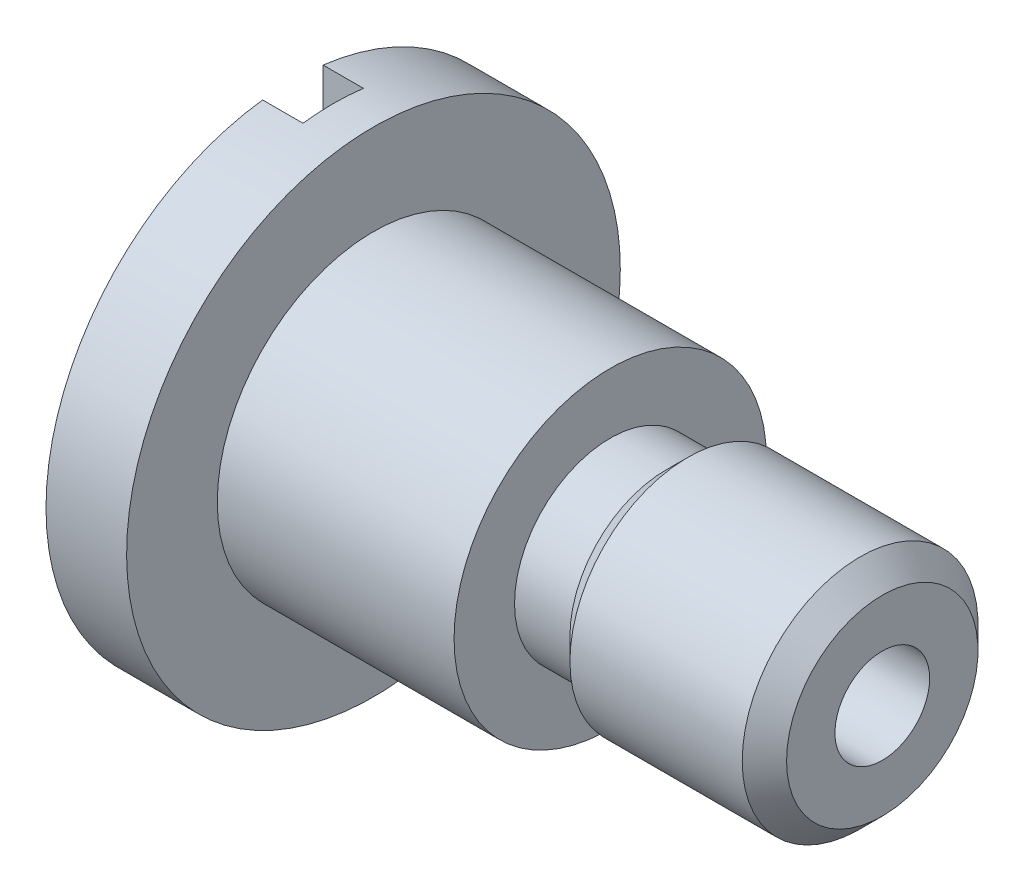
ISO-10303-21;
HEADER;
FILE_DESCRIPTION(('STEP AP214'),'2;1');
FILE_NAME('part.step','',(''),(''),'','','');
FILE_SCHEMA(('AUTOMOTIVE_DESIGN { 1 0 10303 214 1 1 1 1 }'));
ENDSEC;
DATA;
#1=APPLICATION_CONTEXT('core data for automotive mechanical design processes');
#2=APPLICATION_PROTOCOL_DEFINITION('international standard','automotive_design',2000,#1);
#3=PRODUCT_CONTEXT('',#1,'mechanical');
#4=PRODUCT('Part','Part','',(#3));
#5=PRODUCT_RELATED_PRODUCT_CATEGORY('part','',(#4));
#6=PRODUCT_DEFINITION_FORMATION('','',#4);
#7=PRODUCT_DEFINITION_CONTEXT('part definition',#1,'design');
#8=PRODUCT_DEFINITION('design','',#6,#7);
#9=PRODUCT_DEFINITION_SHAPE('','',#8);
#10=(LENGTH_UNIT() NAMED_UNIT(*) SI_UNIT(.MILLI.,.METRE.));
#11=(NAMED_UNIT(*) PLANE_ANGLE_UNIT() SI_UNIT($,.RADIAN.));
#12=(NAMED_UNIT(*) SI_UNIT($,.STERADIAN.) SOLID_ANGLE_UNIT());
#13=UNCERTAINTY_MEASURE_WITH_UNIT(LENGTH_MEASURE(1.E-05),#10,'distance_accuracy_value','');
#14=(GEOMETRIC_REPRESENTATION_CONTEXT(3) GLOBAL_UNCERTAINTY_ASSIGNED_CONTEXT((#13)) GLOBAL_UNIT_ASSIGNED_CONTEXT((#10,
#11,#12)) REPRESENTATION_CONTEXT('',''));
#15=CARTESIAN_POINT('',(0.,0.,0.));
#16=DIRECTION('',(0.,0.,1.));
#17=DIRECTION('',(1.,0.,0.));
#18=AXIS2_PLACEMENT_3D('',#15,#16,#17);
#19=CARTESIAN_POINT('',(1.016,0.,0.));
#20=DIRECTION('',(1.,0.,0.));
#21=DIRECTION('',(0.,0.,-1.));
#22=AXIS2_PLACEMENT_3D('',#19,#20,#21);
#23=PLANE('',#22);
#24=DIRECTION('',(0.,-1.,0.));
#25=VECTOR('',#24,1.);
#26=CARTESIAN_POINT('',(1.016,-6.223,-0.762));
#27=LINE('',#26,#25);
#28=CARTESIAN_POINT('',(1.016,6.17617073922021,-0.762));
#29=VERTEX_POINT('',#28);
#30=CARTESIAN_POINT('',(1.016,0.918974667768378,-0.762));
#31=VERTEX_POINT('',#30);
#32=EDGE_CURVE('E117',#29,#31,#27,.T.);
#33=ORIENTED_EDGE('',*,*,#32,.T.);
#34=CARTESIAN_POINT('',(1.016,0.,0.));
#35=DIRECTION('',(1.,0.,0.));
#36=DIRECTION('',(0.,0.,-1.));
#37=AXIS2_PLACEMENT_3D('',#34,#35,#36);
#38=CIRCLE('',#37,1.1938);
#39=CARTESIAN_POINT('',(1.016,0.918974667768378,0.762));
#40=VERTEX_POINT('',#39);
#41=EDGE_CURVE('E103',#31,#40,#38,.T.);
#42=ORIENTED_EDGE('',*,*,#41,.T.);
#43=DIRECTION('',(0.,1.,0.));
#44=VECTOR('',#43,1.);
#45=CARTESIAN_POINT('',(1.016,-6.223,0.762));
#46=LINE('',#45,#44);
#47=CARTESIAN_POINT('',(1.016,6.17617073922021,0.762));
#48=VERTEX_POINT('',#47);
#49=EDGE_CURVE('E273',#40,#48,#46,.T.);
#50=ORIENTED_EDGE('',*,*,#49,.T.);
#51=CARTESIAN_POINT('',(1.016,0.,0.));
#52=DIRECTION('',(1.,0.,0.));
#53=DIRECTION('',(0.,0.,-1.));
#54=AXIS2_PLACEMENT_3D('',#51,#52,#53);
#55=CIRCLE('',#54,6.223);
#56=EDGE_CURVE('E10',#29,#48,#55,.T.);
#57=ORIENTED_EDGE('',*,*,#56,.F.);
#58=EDGE_LOOP('',(#33,#42,#50,#57));
#59=FACE_BOUND('',#58,.T.);
#60=ADVANCED_FACE('F16',(#59),#23,.F.);
#61=CARTESIAN_POINT('',(1.016,-6.223,0.762));
#62=DIRECTION('',(0.,0.,1.));
#63=DIRECTION('',(1.,0.,0.));
#64=AXIS2_PLACEMENT_3D('',#61,#62,#63);
#65=PLANE('',#64);
#66=DIRECTION('',(0.,-1.,0.));
#67=VECTOR('',#66,1.);
#68=CARTESIAN_POINT('',(0.,0.,0.762));
#69=LINE('',#68,#67);
#70=CARTESIAN_POINT('',(0.,-0.918974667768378,0.762));
#71=VERTEX_POINT('',#70);
#72=CARTESIAN_POINT('',(0.,-6.17617073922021,0.762));
#73=VERTEX_POINT('',#72);
#74=EDGE_CURVE('E189',#71,#73,#69,.T.);
#75=ORIENTED_EDGE('',*,*,#74,.F.);
#76=DIRECTION('',(1.,0.,0.));
#77=VECTOR('',#76,1.);
#78=CARTESIAN_POINT('',(0.,-0.918974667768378,0.762));
#79=LINE('',#78,#77);
#80=CARTESIAN_POINT('',(1.016,-0.918974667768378,0.762));
#81=VERTEX_POINT('',#80);
#82=EDGE_CURVE('E235',#71,#81,#79,.T.);
#83=ORIENTED_EDGE('',*,*,#82,.T.);
#84=CARTESIAN_POINT('',(1.016,-6.17617073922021,0.762));
#85=VERTEX_POINT('',#84);
#86=EDGE_CURVE('E135',#85,#81,#46,.T.);
#87=ORIENTED_EDGE('',*,*,#86,.F.);
#88=DIRECTION('',(-1.,0.,0.));
#89=VECTOR('',#88,1.);
#90=CARTESIAN_POINT('',(0.,-6.17617073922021,0.762));
#91=LINE('',#90,#89);
#92=EDGE_CURVE('E142',#73,#85,#91,.F.);
#93=ORIENTED_EDGE('',*,*,#92,.F.);
#94=EDGE_LOOP('',(#75,#83,#87,#93));
#95=FACE_BOUND('',#94,.T.);
#96=ADVANCED_FACE('F213',(#95),#65,.F.);
#97=CARTESIAN_POINT('',(1.016,-6.223,-0.762));
#98=DIRECTION('',(0.,0.,-1.));
#99=DIRECTION('',(-1.,0.,0.));
#100=AXIS2_PLACEMENT_3D('',#97,#98,#99);
#101=PLANE('',#100);
#102=DIRECTION('',(0.,1.,0.));
#103=VECTOR('',#102,1.);
#104=CARTESIAN_POINT('',(0.,0.,-0.762));
#105=LINE('',#104,#103);
#106=CARTESIAN_POINT('',(0.,0.918974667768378,-0.762));
#107=VERTEX_POINT('',#106);
#108=CARTESIAN_POINT('',(0.,6.17617073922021,-0.762));
#109=VERTEX_POINT('',#108);
#110=EDGE_CURVE('E47',#107,#109,#105,.T.);
#111=ORIENTED_EDGE('',*,*,#110,.F.);
#112=DIRECTION('',(1.,0.,0.));
#113=VECTOR('',#112,1.);
#114=CARTESIAN_POINT('',(0.,0.918974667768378,-0.762));
#115=LINE('',#114,#113);
#116=EDGE_CURVE('E36',#107,#31,#115,.T.);
#117=ORIENTED_EDGE('',*,*,#116,.T.);
#118=ORIENTED_EDGE('',*,*,#32,.F.);
#119=DIRECTION('',(-1.,0.,0.));
#120=VECTOR('',#119,1.);
#121=CARTESIAN_POINT('',(0.,6.17617073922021,-0.762));
#122=LINE('',#121,#120);
#123=EDGE_CURVE('E123',#109,#29,#122,.F.);
#124=ORIENTED_EDGE('',*,*,#123,.F.);
#125=EDGE_LOOP('',(#111,#117,#118,#124));
#126=FACE_BOUND('',#125,.T.);
#127=ADVANCED_FACE('F116',(#126),#101,.F.);
#128=ORIENTED_EDGE('',*,*,#86,.T.);
#129=CARTESIAN_POINT('',(1.016,-0.918974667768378,-0.762));
#130=VERTEX_POINT('',#129);
#131=EDGE_CURVE('E113',#81,#130,#38,.T.);
#132=ORIENTED_EDGE('',*,*,#131,.T.);
#133=CARTESIAN_POINT('',(1.016,-6.17617073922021,-0.762));
#134=VERTEX_POINT('',#133);
#135=EDGE_CURVE('E124',#130,#134,#27,.T.);
#136=ORIENTED_EDGE('',*,*,#135,.T.);
#137=EDGE_CURVE('E20',#85,#134,#55,.T.);
#138=ORIENTED_EDGE('',*,*,#137,.F.);
#139=EDGE_LOOP('',(#128,#132,#136,#138));
#140=FACE_BOUND('',#139,.T.);
#141=ADVANCED_FACE('F452',(#140),#23,.F.);
#142=ORIENTED_EDGE('',*,*,#49,.F.);
#143=DIRECTION('',(1.,0.,0.));
#144=VECTOR('',#143,1.);
#145=CARTESIAN_POINT('',(0.,0.918974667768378,0.762));
#146=LINE('',#145,#144);
#147=CARTESIAN_POINT('',(0.,0.918974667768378,0.762));
#148=VERTEX_POINT('',#147);
#149=EDGE_CURVE('E106',#40,#148,#146,.F.);
#150=ORIENTED_EDGE('',*,*,#149,.T.);
#151=CARTESIAN_POINT('',(0.,6.17617073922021,0.762));
#152=VERTEX_POINT('',#151);
#153=EDGE_CURVE('E190',#152,#148,#69,.T.);
#154=ORIENTED_EDGE('',*,*,#153,.F.);
#155=DIRECTION('',(-1.,0.,0.));
#156=VECTOR('',#155,1.);
#157=CARTESIAN_POINT('',(0.,6.17617073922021,0.762));
#158=LINE('',#157,#156);
#159=EDGE_CURVE('E146',#48,#152,#158,.T.);
#160=ORIENTED_EDGE('',*,*,#159,.F.);
#161=EDGE_LOOP('',(#142,#150,#154,#160));
#162=FACE_BOUND('',#161,.T.);
#163=ADVANCED_FACE('F363',(#162),#65,.F.);
#164=ORIENTED_EDGE('',*,*,#135,.F.);
#165=DIRECTION('',(1.,0.,0.));
#166=VECTOR('',#165,1.);
#167=CARTESIAN_POINT('',(0.,-0.918974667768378,-0.762));
#168=LINE('',#167,#166);
#169=CARTESIAN_POINT('',(0.,-0.918974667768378,-0.762));
#170=VERTEX_POINT('',#169);
#171=EDGE_CURVE('E375',#130,#170,#168,.F.);
#172=ORIENTED_EDGE('',*,*,#171,.T.);
#173=CARTESIAN_POINT('',(0.,-6.17617073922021,-0.762));
#174=VERTEX_POINT('',#173);
#175=EDGE_CURVE('E186',#174,#170,#105,.T.);
#176=ORIENTED_EDGE('',*,*,#175,.F.);
#177=DIRECTION('',(-1.,0.,0.));
#178=VECTOR('',#177,1.);
#179=CARTESIAN_POINT('',(0.,-6.17617073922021,-0.762));
#180=LINE('',#179,#178);
#181=EDGE_CURVE('E132',#134,#174,#180,.T.);
#182=ORIENTED_EDGE('',*,*,#181,.F.);
#183=EDGE_LOOP('',(#164,#172,#176,#182));
#184=FACE_BOUND('',#183,.T.);
#185=ADVANCED_FACE('F342',(#184),#101,.F.);
#186=CARTESIAN_POINT('',(0.,0.,0.));
#187=DIRECTION('',(1.,0.,0.));
#188=DIRECTION('',(0.,0.,-1.));
#189=AXIS2_PLACEMENT_3D('',#186,#187,#188);
#190=PLANE('',#189);
#191=ORIENTED_EDGE('',*,*,#153,.T.);
#192=CARTESIAN_POINT('',(0.,0.,0.));
#193=DIRECTION('',(1.,0.,0.));
#194=DIRECTION('',(0.,0.,-1.));
#195=AXIS2_PLACEMENT_3D('',#192,#193,#194);
#196=CIRCLE('',#195,1.1938);
#197=EDGE_CURVE('E209',#148,#71,#196,.T.);
#198=ORIENTED_EDGE('',*,*,#197,.T.);
#199=ORIENTED_EDGE('',*,*,#74,.T.);
#200=CARTESIAN_POINT('',(0.,0.,0.));
#201=DIRECTION('',(1.,0.,0.));
#202=DIRECTION('',(0.,0.,-1.));
#203=AXIS2_PLACEMENT_3D('',#200,#201,#202);
#204=CIRCLE('',#203,6.223);
#205=EDGE_CURVE('E161',#73,#152,#204,.F.);
#206=ORIENTED_EDGE('',*,*,#205,.T.);
#207=EDGE_LOOP('',(#191,#198,#199,#206));
#208=FACE_BOUND('',#207,.T.);
#209=ADVANCED_FACE('F207',(#208),#190,.F.);
#210=CARTESIAN_POINT('',(2.032,5.842,0.));
#211=DIRECTION('',(-1.,0.,0.));
#212=DIRECTION('',(0.,0.,1.));
#213=AXIS2_PLACEMENT_3D('',#210,#211,#212);
#214=PLANE('',#213);
#215=CARTESIAN_POINT('',(2.032,0.,0.));
#216=DIRECTION('',(-1.,0.,0.));
#217=DIRECTION('',(0.,0.,1.));
#218=AXIS2_PLACEMENT_3D('',#215,#216,#217);
#219=CIRCLE('',#218,3.937);
#220=CARTESIAN_POINT('',(2.032,0.,3.937));
#221=VERTEX_POINT('',#220);
#222=EDGE_CURVE('E182',#221,#221,#219,.T.);
#223=ORIENTED_EDGE('',*,*,#222,.T.);
#224=EDGE_LOOP('',(#223));
#225=FACE_BOUND('',#224,.T.);
#226=CARTESIAN_POINT('',(2.032,0.,0.));
#227=DIRECTION('',(1.,0.,0.));
#228=DIRECTION('',(0.,0.,-1.));
#229=AXIS2_PLACEMENT_3D('',#226,#227,#228);
#230=CIRCLE('',#229,6.223);
#231=CARTESIAN_POINT('',(2.032,0.,-6.223));
#232=VERTEX_POINT('',#231);
#233=EDGE_CURVE('E154',#232,#232,#230,.T.);
#234=ORIENTED_EDGE('',*,*,#233,.T.);
#235=EDGE_LOOP('',(#234));
#236=FACE_BOUND('',#235,.T.);
#237=ADVANCED_FACE('F229',(#225,#236),#214,.F.);
#238=CARTESIAN_POINT('',(0.,0.,0.));
#239=DIRECTION('',(-1.,0.,0.));
#240=DIRECTION('',(0.,0.,1.));
#241=AXIS2_PLACEMENT_3D('',#238,#239,#240);
#242=CYLINDRICAL_SURFACE('',#241,3.937);
#243=ORIENTED_EDGE('',*,*,#222,.F.);
#244=EDGE_LOOP('',(#243));
#245=FACE_BOUND('',#244,.T.);
#246=CARTESIAN_POINT('',(8.001,0.,0.));
#247=DIRECTION('',(1.,0.,0.));
#248=DIRECTION('',(0.,0.,-1.));
#249=AXIS2_PLACEMENT_3D('',#246,#247,#248);
#250=CIRCLE('',#249,3.937);
#251=CARTESIAN_POINT('',(8.001,0.,-3.937));
#252=VERTEX_POINT('',#251);
#253=EDGE_CURVE('E150',#252,#252,#250,.T.);
#254=ORIENTED_EDGE('',*,*,#253,.F.);
#255=EDGE_LOOP('',(#254));
#256=FACE_BOUND('',#255,.T.);
#257=ADVANCED_FACE('F258',(#245,#256),#242,.T.);
#258=CARTESIAN_POINT('',(0.,0.,0.));
#259=DIRECTION('',(-1.,0.,0.));
#260=DIRECTION('',(0.,0.,1.));
#261=AXIS2_PLACEMENT_3D('',#258,#259,#260);
#262=CYLINDRICAL_SURFACE('',#261,6.223);
#263=ORIENTED_EDGE('',*,*,#56,.T.);
#264=ORIENTED_EDGE('',*,*,#159,.T.);
#265=ORIENTED_EDGE('',*,*,#205,.F.);
#266=ORIENTED_EDGE('',*,*,#92,.T.);
#267=ORIENTED_EDGE('',*,*,#137,.T.);
#268=ORIENTED_EDGE('',*,*,#181,.T.);
#269=EDGE_CURVE('E158',#109,#174,#204,.F.);
#270=ORIENTED_EDGE('',*,*,#269,.F.);
#271=ORIENTED_EDGE('',*,*,#123,.T.);
#272=EDGE_LOOP('',(#263,#264,#265,#266,#267,#268,#270,#271));
#273=FACE_BOUND('',#272,.T.);
#274=ORIENTED_EDGE('',*,*,#233,.F.);
#275=EDGE_LOOP('',(#274));
#276=FACE_BOUND('',#275,.T.);
#277=ADVANCED_FACE('F216',(#273,#276),#262,.T.);
#278=ORIENTED_EDGE('',*,*,#175,.T.);
#279=EDGE_CURVE('E120',#170,#107,#196,.T.);
#280=ORIENTED_EDGE('',*,*,#279,.T.);
#281=ORIENTED_EDGE('',*,*,#110,.T.);
#282=ORIENTED_EDGE('',*,*,#269,.T.);
#283=EDGE_LOOP('',(#278,#280,#281,#282));
#284=FACE_BOUND('',#283,.T.);
#285=ADVANCED_FACE('F18',(#284),#190,.F.);
#286=CARTESIAN_POINT('',(9.9568,0.,0.));
#287=DIRECTION('',(1.,0.,0.));
#288=DIRECTION('',(0.,0.,-1.));
#289=AXIS2_PLACEMENT_3D('',#286,#287,#288);
#290=CONICAL_SURFACE('',#289,2.9718,0.785398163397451);
#291=CARTESIAN_POINT('',(9.398,0.,0.));
#292=DIRECTION('',(-1.,0.,0.));
#293=DIRECTION('',(0.,0.,1.));
#294=AXIS2_PLACEMENT_3D('',#291,#292,#293);
#295=CIRCLE('',#294,2.413);
#296=CARTESIAN_POINT('',(9.398,0.,2.413));
#297=VERTEX_POINT('',#296);
#298=EDGE_CURVE('E174',#297,#297,#295,.T.);
#299=ORIENTED_EDGE('',*,*,#298,.F.);
#300=EDGE_LOOP('',(#299));
#301=FACE_BOUND('',#300,.T.);
#302=CARTESIAN_POINT('',(9.9568,0.,0.));
#303=DIRECTION('',(-1.,0.,0.));
#304=DIRECTION('',(0.,0.,1.));
#305=AXIS2_PLACEMENT_3D('',#302,#303,#304);
#306=CIRCLE('',#305,2.9718);
#307=CARTESIAN_POINT('',(9.9568,0.,2.9718));
#308=VERTEX_POINT('',#307);
#309=EDGE_CURVE('E170',#308,#308,#306,.T.);
#310=ORIENTED_EDGE('',*,*,#309,.T.);
#311=EDGE_LOOP('',(#310));
#312=FACE_BOUND('',#311,.T.);
#313=ADVANCED_FACE('F407',(#301,#312),#290,.T.);
#314=CARTESIAN_POINT('',(0.,0.,0.));
#315=DIRECTION('',(-1.,0.,0.));
#316=DIRECTION('',(0.,0.,1.));
#317=AXIS2_PLACEMENT_3D('',#314,#315,#316);
#318=CYLINDRICAL_SURFACE('',#317,2.413);
#319=CARTESIAN_POINT('',(8.001,0.,0.));
#320=DIRECTION('',(-1.,0.,0.));
#321=DIRECTION('',(0.,0.,1.));
#322=AXIS2_PLACEMENT_3D('',#319,#320,#321);
#323=CIRCLE('',#322,2.413);
#324=CARTESIAN_POINT('',(8.001,0.,2.413));
#325=VERTEX_POINT('',#324);
#326=EDGE_CURVE('E178',#325,#325,#323,.T.);
#327=ORIENTED_EDGE('',*,*,#326,.F.);
#328=EDGE_LOOP('',(#327));
#329=FACE_BOUND('',#328,.T.);
#330=ORIENTED_EDGE('',*,*,#298,.T.);
#331=EDGE_LOOP('',(#330));
#332=FACE_BOUND('',#331,.T.);
#333=ADVANCED_FACE('F397',(#329,#332),#318,.T.);
#334=CARTESIAN_POINT('',(8.001,3.42899999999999,0.));
#335=DIRECTION('',(-1.,0.,0.));
#336=DIRECTION('',(0.,0.,1.));
#337=AXIS2_PLACEMENT_3D('',#334,#335,#336);
#338=PLANE('',#337);
#339=ORIENTED_EDGE('',*,*,#326,.T.);
#340=EDGE_LOOP('',(#339));
#341=FACE_BOUND('',#340,.T.);
#342=ORIENTED_EDGE('',*,*,#253,.T.);
#343=EDGE_LOOP('',(#342));
#344=FACE_BOUND('',#343,.T.);
#345=ADVANCED_FACE('F381',(#341,#344),#338,.F.);
#346=CARTESIAN_POINT('',(0.,0.,0.));
#347=DIRECTION('',(-1.,0.,0.));
#348=DIRECTION('',(0.,0.,1.));
#349=AXIS2_PLACEMENT_3D('',#346,#347,#348);
#350=CYLINDRICAL_SURFACE('',#349,2.9718);
#351=ORIENTED_EDGE('',*,*,#309,.F.);
#352=EDGE_LOOP('',(#351));
#353=FACE_BOUND('',#352,.T.);
#354=CARTESIAN_POINT('',(14.3002,0.,0.));
#355=DIRECTION('',(-1.,0.,0.));
#356=DIRECTION('',(0.,0.,1.));
#357=AXIS2_PLACEMENT_3D('',#354,#355,#356);
#358=CIRCLE('',#357,2.9718);
#359=CARTESIAN_POINT('',(14.3002,0.,2.9718));
#360=VERTEX_POINT('',#359);
#361=EDGE_CURVE('E166',#360,#360,#358,.T.);
#362=ORIENTED_EDGE('',*,*,#361,.T.);
#363=EDGE_LOOP('',(#362));
#364=FACE_BOUND('',#363,.T.);
#365=ADVANCED_FACE('F351',(#353,#364),#350,.T.);
#366=CARTESIAN_POINT('',(14.859,0.,0.));
#367=DIRECTION('',(-1.,0.,0.));
#368=DIRECTION('',(0.,0.,1.));
#369=AXIS2_PLACEMENT_3D('',#366,#367,#368);
#370=CONICAL_SURFACE('',#369,2.413,0.785398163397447);
#371=ORIENTED_EDGE('',*,*,#361,.F.);
#372=EDGE_LOOP('',(#371));
#373=FACE_BOUND('',#372,.T.);
#374=CARTESIAN_POINT('',(14.859,0.,0.));
#375=DIRECTION('',(-1.,0.,0.));
#376=DIRECTION('',(0.,0.,1.));
#377=AXIS2_PLACEMENT_3D('',#374,#375,#376);
#378=CIRCLE('',#377,2.413);
#379=CARTESIAN_POINT('',(14.859,0.,2.413));
#380=VERTEX_POINT('',#379);
#381=EDGE_CURVE('E162',#380,#380,#378,.T.);
#382=ORIENTED_EDGE('',*,*,#381,.T.);
#383=EDGE_LOOP('',(#382));
#384=FACE_BOUND('',#383,.T.);
#385=ADVANCED_FACE('F320',(#373,#384),#370,.T.);
#386=CARTESIAN_POINT('',(14.859,2.413,0.));
#387=DIRECTION('',(-1.,0.,0.));
#388=DIRECTION('',(0.,0.,1.));
#389=AXIS2_PLACEMENT_3D('',#386,#387,#388);
#390=PLANE('',#389);
#391=CARTESIAN_POINT('',(14.859,0.,0.));
#392=DIRECTION('',(1.,0.,0.));
#393=DIRECTION('',(0.,0.,-1.));
#394=AXIS2_PLACEMENT_3D('',#391,#392,#393);
#395=CIRCLE('',#394,1.1938);
#396=CARTESIAN_POINT('',(14.859,0.,-1.1938));
#397=VERTEX_POINT('',#396);
#398=EDGE_CURVE('E111',#397,#397,#395,.T.);
#399=ORIENTED_EDGE('',*,*,#398,.F.);
#400=EDGE_LOOP('',(#399));
#401=FACE_BOUND('',#400,.T.);
#402=ORIENTED_EDGE('',*,*,#381,.F.);
#403=EDGE_LOOP('',(#402));
#404=FACE_BOUND('',#403,.T.);
#405=ADVANCED_FACE('F250',(#401,#404),#390,.F.);
#406=CARTESIAN_POINT('',(0.,0.,0.));
#407=DIRECTION('',(1.,0.,0.));
#408=DIRECTION('',(0.,0.,-1.));
#409=AXIS2_PLACEMENT_3D('',#406,#407,#408);
#410=CYLINDRICAL_SURFACE('',#409,1.1938);
#411=ORIENTED_EDGE('',*,*,#398,.T.);
#412=EDGE_LOOP('',(#411));
#413=FACE_BOUND('',#412,.T.);
#414=ORIENTED_EDGE('',*,*,#41,.F.);
#415=ORIENTED_EDGE('',*,*,#116,.F.);
#416=ORIENTED_EDGE('',*,*,#279,.F.);
#417=ORIENTED_EDGE('',*,*,#171,.F.);
#418=ORIENTED_EDGE('',*,*,#131,.F.);
#419=ORIENTED_EDGE('',*,*,#82,.F.);
#420=ORIENTED_EDGE('',*,*,#197,.F.);
#421=ORIENTED_EDGE('',*,*,#149,.F.);
#422=EDGE_LOOP('',(#414,#415,#416,#417,#418,#419,#420,#421));
#423=FACE_BOUND('',#422,.T.);
#424=ADVANCED_FACE('F104',(#413,#423),#410,.F.);
#425=CLOSED_SHELL('',(#60,#96,#127,#141,#163,#185,#209,#237,#257,#277,#285,#313,#333,#345,#365,
#385,#405,#424));
#426=MANIFOLD_SOLID_BREP('B1',#425);
#427=ADVANCED_BREP_SHAPE_REPRESENTATION('',(#18,#426),#14);
#428=SHAPE_DEFINITION_REPRESENTATION(#9,#427);
ENDSEC;
END-ISO-10303-21;
